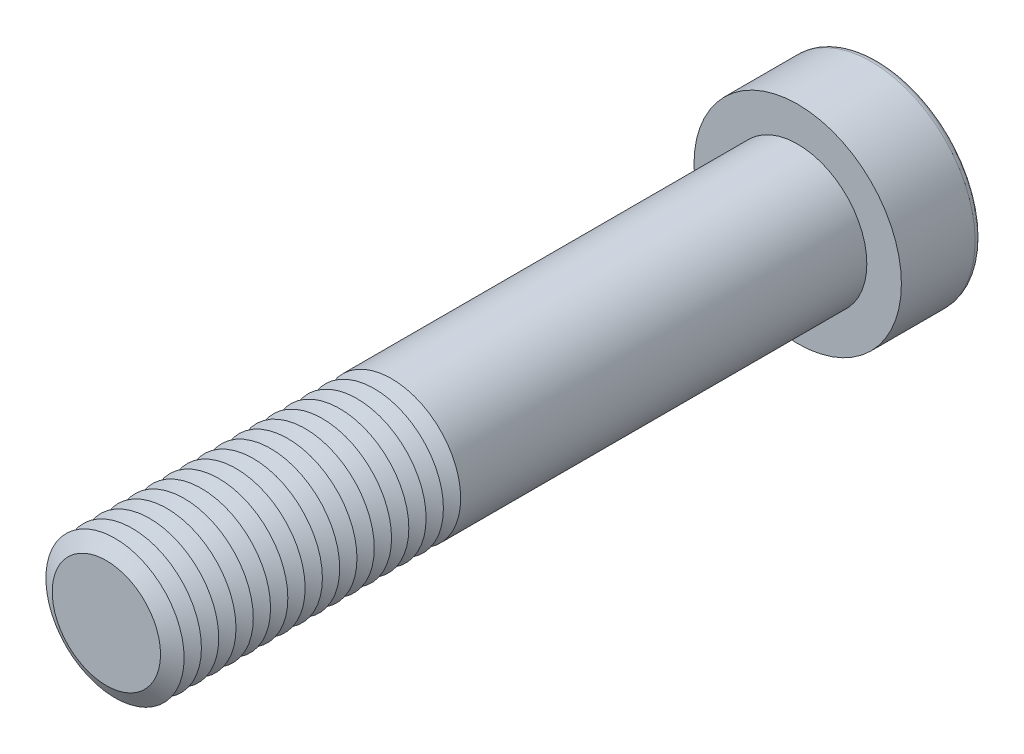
ISO-10303-21;
HEADER;
FILE_DESCRIPTION(('STEP AP214'),'2;1');
FILE_NAME('part.step','',(''),(''),'','','');
FILE_SCHEMA(('AUTOMOTIVE_DESIGN { 1 0 10303 214 1 1 1 1 }'));
ENDSEC;
DATA;
#1=APPLICATION_CONTEXT('core data for automotive mechanical design processes');
#2=APPLICATION_PROTOCOL_DEFINITION('international standard','automotive_design',2000,#1);
#3=PRODUCT_CONTEXT('',#1,'mechanical');
#4=PRODUCT('Part','Part','',(#3));
#5=PRODUCT_RELATED_PRODUCT_CATEGORY('part','',(#4));
#6=PRODUCT_DEFINITION_FORMATION('','',#4);
#7=PRODUCT_DEFINITION_CONTEXT('part definition',#1,'design');
#8=PRODUCT_DEFINITION('design','',#6,#7);
#9=PRODUCT_DEFINITION_SHAPE('','',#8);
#10=(LENGTH_UNIT() NAMED_UNIT(*) SI_UNIT(.MILLI.,.METRE.));
#11=(NAMED_UNIT(*) PLANE_ANGLE_UNIT() SI_UNIT($,.RADIAN.));
#12=(NAMED_UNIT(*) SI_UNIT($,.STERADIAN.) SOLID_ANGLE_UNIT());
#13=UNCERTAINTY_MEASURE_WITH_UNIT(LENGTH_MEASURE(1.E-05),#10,'distance_accuracy_value','');
#14=(GEOMETRIC_REPRESENTATION_CONTEXT(3) GLOBAL_UNCERTAINTY_ASSIGNED_CONTEXT((#13)) GLOBAL_UNIT_ASSIGNED_CONTEXT((#10,
#11,#12)) REPRESENTATION_CONTEXT('',''));
#15=CARTESIAN_POINT('',(0.,0.,0.));
#16=DIRECTION('',(0.,0.,1.));
#17=DIRECTION('',(1.,0.,0.));
#18=AXIS2_PLACEMENT_3D('',#15,#16,#17);
#19=CARTESIAN_POINT('',(0.,0.,109.5));
#20=DIRECTION('',(0.,0.,1.));
#21=DIRECTION('',(1.,0.,0.));
#22=AXIS2_PLACEMENT_3D('',#19,#20,#21);
#23=CONICAL_SURFACE('',#22,12.,1.0471975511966);
#24=CARTESIAN_POINT('',(0.,0.,108.));
#25=DIRECTION('',(0.,0.,1.));
#26=DIRECTION('',(1.,0.,0.));
#27=AXIS2_PLACEMENT_3D('',#24,#25,#26);
#28=CIRCLE('',#27,9.40192378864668);
#29=CARTESIAN_POINT('',(9.40192378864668,0.,108.));
#30=VERTEX_POINT('',#29);
#31=EDGE_CURVE('E313',#30,#30,#28,.T.);
#32=ORIENTED_EDGE('',*,*,#31,.T.);
#33=EDGE_LOOP('',(#32));
#34=FACE_BOUND('',#33,.T.);
#35=CARTESIAN_POINT('',(0.,0.,109.5));
#36=DIRECTION('',(0.,0.,1.));
#37=DIRECTION('',(1.,0.,0.));
#38=AXIS2_PLACEMENT_3D('',#35,#36,#37);
#39=CIRCLE('',#38,12.);
#40=CARTESIAN_POINT('',(12.,0.,109.5));
#41=VERTEX_POINT('',#40);
#42=EDGE_CURVE('E316',#41,#41,#39,.T.);
#43=ORIENTED_EDGE('',*,*,#42,.F.);
#44=EDGE_LOOP('',(#43));
#45=FACE_BOUND('',#44,.T.);
#46=ADVANCED_FACE('F39',(#34,#45),#23,.T.);
#47=CARTESIAN_POINT('',(0.,0.,108.));
#48=DIRECTION('',(0.,0.,-1.));
#49=DIRECTION('',(-1.,0.,0.));
#50=AXIS2_PLACEMENT_3D('',#47,#48,#49);
#51=CONICAL_SURFACE('',#50,9.40192378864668,1.0471975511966);
#52=CARTESIAN_POINT('',(0.,0.,106.5));
#53=DIRECTION('',(0.,0.,1.));
#54=DIRECTION('',(1.,0.,0.));
#55=AXIS2_PLACEMENT_3D('',#52,#53,#54);
#56=CIRCLE('',#55,12.);
#57=CARTESIAN_POINT('',(12.,0.,106.5));
#58=VERTEX_POINT('',#57);
#59=EDGE_CURVE('E324',#58,#58,#56,.T.);
#60=ORIENTED_EDGE('',*,*,#59,.T.);
#61=EDGE_LOOP('',(#60));
#62=FACE_BOUND('',#61,.T.);
#63=ORIENTED_EDGE('',*,*,#31,.F.);
#64=EDGE_LOOP('',(#63));
#65=FACE_BOUND('',#64,.T.);
#66=ADVANCED_FACE('F245',(#62,#65),#51,.T.);
#67=CARTESIAN_POINT('',(0.,0.,120.));
#68=DIRECTION('',(0.,0.,1.));
#69=DIRECTION('',(1.,0.,0.));
#70=AXIS2_PLACEMENT_3D('',#67,#68,#69);
#71=PLANE('',#70);
#72=CARTESIAN_POINT('',(0.,0.,120.));
#73=DIRECTION('',(0.,0.,1.));
#74=DIRECTION('',(1.,0.,0.));
#75=AXIS2_PLACEMENT_3D('',#72,#73,#74);
#76=CIRCLE('',#75,9.40192378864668);
#77=CARTESIAN_POINT('',(9.40192378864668,0.,120.));
#78=VERTEX_POINT('',#77);
#79=EDGE_CURVE('E174',#78,#78,#76,.T.);
#80=ORIENTED_EDGE('',*,*,#79,.T.);
#81=EDGE_LOOP('',(#80));
#82=FACE_BOUND('',#81,.T.);
#83=ADVANCED_FACE('F251',(#82),#71,.T.);
#84=CARTESIAN_POINT('',(0.,0.,120.));
#85=DIRECTION('',(0.,0.,-1.));
#86=DIRECTION('',(-1.,0.,0.));
#87=AXIS2_PLACEMENT_3D('',#84,#85,#86);
#88=CONICAL_SURFACE('',#87,9.40192378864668,1.0471975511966);
#89=CARTESIAN_POINT('',(0.,0.,118.5));
#90=DIRECTION('',(0.,0.,1.));
#91=DIRECTION('',(1.,0.,0.));
#92=AXIS2_PLACEMENT_3D('',#89,#90,#91);
#93=CIRCLE('',#92,12.);
#94=CARTESIAN_POINT('',(12.,0.,118.5));
#95=VERTEX_POINT('',#94);
#96=EDGE_CURVE('E291',#95,#95,#93,.T.);
#97=ORIENTED_EDGE('',*,*,#96,.T.);
#98=EDGE_LOOP('',(#97));
#99=FACE_BOUND('',#98,.T.);
#100=ORIENTED_EDGE('',*,*,#79,.F.);
#101=EDGE_LOOP('',(#100));
#102=FACE_BOUND('',#101,.T.);
#103=ADVANCED_FACE('F199',(#99,#102),#88,.T.);
#104=CARTESIAN_POINT('',(0.,0.,118.5));
#105=DIRECTION('',(0.,0.,1.));
#106=DIRECTION('',(1.,0.,0.));
#107=AXIS2_PLACEMENT_3D('',#104,#105,#106);
#108=CONICAL_SURFACE('',#107,12.,1.0471975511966);
#109=CARTESIAN_POINT('',(0.,0.,117.));
#110=DIRECTION('',(0.,0.,1.));
#111=DIRECTION('',(1.,0.,0.));
#112=AXIS2_PLACEMENT_3D('',#109,#110,#111);
#113=CIRCLE('',#112,9.40192378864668);
#114=CARTESIAN_POINT('',(9.40192378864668,0.,117.));
#115=VERTEX_POINT('',#114);
#116=EDGE_CURVE('E288',#115,#115,#113,.T.);
#117=ORIENTED_EDGE('',*,*,#116,.T.);
#118=EDGE_LOOP('',(#117));
#119=FACE_BOUND('',#118,.T.);
#120=ORIENTED_EDGE('',*,*,#96,.F.);
#121=EDGE_LOOP('',(#120));
#122=FACE_BOUND('',#121,.T.);
#123=ADVANCED_FACE('F277',(#119,#122),#108,.T.);
#124=CARTESIAN_POINT('',(0.,0.,117.));
#125=DIRECTION('',(0.,0.,-1.));
#126=DIRECTION('',(-1.,0.,0.));
#127=AXIS2_PLACEMENT_3D('',#124,#125,#126);
#128=CONICAL_SURFACE('',#127,9.40192378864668,1.0471975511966);
#129=CARTESIAN_POINT('',(0.,0.,115.5));
#130=DIRECTION('',(0.,0.,1.));
#131=DIRECTION('',(1.,0.,0.));
#132=AXIS2_PLACEMENT_3D('',#129,#130,#131);
#133=CIRCLE('',#132,12.);
#134=CARTESIAN_POINT('',(12.,0.,115.5));
#135=VERTEX_POINT('',#134);
#136=EDGE_CURVE('E300',#135,#135,#133,.T.);
#137=ORIENTED_EDGE('',*,*,#136,.T.);
#138=EDGE_LOOP('',(#137));
#139=FACE_BOUND('',#138,.T.);
#140=ORIENTED_EDGE('',*,*,#116,.F.);
#141=EDGE_LOOP('',(#140));
#142=FACE_BOUND('',#141,.T.);
#143=ADVANCED_FACE('F274',(#139,#142),#128,.T.);
#144=CARTESIAN_POINT('',(0.,0.,115.5));
#145=DIRECTION('',(0.,0.,1.));
#146=DIRECTION('',(1.,0.,0.));
#147=AXIS2_PLACEMENT_3D('',#144,#145,#146);
#148=CONICAL_SURFACE('',#147,12.,1.0471975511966);
#149=CARTESIAN_POINT('',(0.,0.,114.));
#150=DIRECTION('',(0.,0.,1.));
#151=DIRECTION('',(1.,0.,0.));
#152=AXIS2_PLACEMENT_3D('',#149,#150,#151);
#153=CIRCLE('',#152,9.40192378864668);
#154=CARTESIAN_POINT('',(9.40192378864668,0.,114.));
#155=VERTEX_POINT('',#154);
#156=EDGE_CURVE('E293',#155,#155,#153,.T.);
#157=ORIENTED_EDGE('',*,*,#156,.T.);
#158=EDGE_LOOP('',(#157));
#159=FACE_BOUND('',#158,.T.);
#160=ORIENTED_EDGE('',*,*,#136,.F.);
#161=EDGE_LOOP('',(#160));
#162=FACE_BOUND('',#161,.T.);
#163=ADVANCED_FACE('F270',(#159,#162),#148,.T.);
#164=CARTESIAN_POINT('',(0.,0.,114.));
#165=DIRECTION('',(0.,0.,-1.));
#166=DIRECTION('',(-1.,0.,0.));
#167=AXIS2_PLACEMENT_3D('',#164,#165,#166);
#168=CONICAL_SURFACE('',#167,9.40192378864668,1.0471975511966);
#169=CARTESIAN_POINT('',(0.,0.,112.5));
#170=DIRECTION('',(0.,0.,1.));
#171=DIRECTION('',(1.,0.,0.));
#172=AXIS2_PLACEMENT_3D('',#169,#170,#171);
#173=CIRCLE('',#172,12.);
#174=CARTESIAN_POINT('',(12.,0.,112.5));
#175=VERTEX_POINT('',#174);
#176=EDGE_CURVE('E309',#175,#175,#173,.T.);
#177=ORIENTED_EDGE('',*,*,#176,.T.);
#178=EDGE_LOOP('',(#177));
#179=FACE_BOUND('',#178,.T.);
#180=ORIENTED_EDGE('',*,*,#156,.F.);
#181=EDGE_LOOP('',(#180));
#182=FACE_BOUND('',#181,.T.);
#183=ADVANCED_FACE('F266',(#179,#182),#168,.T.);
#184=CARTESIAN_POINT('',(0.,0.,112.5));
#185=DIRECTION('',(0.,0.,1.));
#186=DIRECTION('',(1.,0.,0.));
#187=AXIS2_PLACEMENT_3D('',#184,#185,#186);
#188=CONICAL_SURFACE('',#187,12.,1.0471975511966);
#189=CARTESIAN_POINT('',(0.,0.,111.));
#190=DIRECTION('',(0.,0.,1.));
#191=DIRECTION('',(1.,0.,0.));
#192=AXIS2_PLACEMENT_3D('',#189,#190,#191);
#193=CIRCLE('',#192,9.40192378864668);
#194=CARTESIAN_POINT('',(9.40192378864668,0.,111.));
#195=VERTEX_POINT('',#194);
#196=EDGE_CURVE('E306',#195,#195,#193,.T.);
#197=ORIENTED_EDGE('',*,*,#196,.T.);
#198=EDGE_LOOP('',(#197));
#199=FACE_BOUND('',#198,.T.);
#200=ORIENTED_EDGE('',*,*,#176,.F.);
#201=EDGE_LOOP('',(#200));
#202=FACE_BOUND('',#201,.T.);
#203=ADVANCED_FACE('F262',(#199,#202),#188,.T.);
#204=CARTESIAN_POINT('',(0.,0.,111.));
#205=DIRECTION('',(0.,0.,-1.));
#206=DIRECTION('',(-1.,0.,0.));
#207=AXIS2_PLACEMENT_3D('',#204,#205,#206);
#208=CONICAL_SURFACE('',#207,9.40192378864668,1.0471975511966);
#209=ORIENTED_EDGE('',*,*,#42,.T.);
#210=EDGE_LOOP('',(#209));
#211=FACE_BOUND('',#210,.T.);
#212=ORIENTED_EDGE('',*,*,#196,.F.);
#213=EDGE_LOOP('',(#212));
#214=FACE_BOUND('',#213,.T.);
#215=ADVANCED_FACE('F258',(#211,#214),#208,.T.);
#216=CARTESIAN_POINT('',(0.,0.,106.5));
#217=DIRECTION('',(0.,0.,1.));
#218=DIRECTION('',(1.,0.,0.));
#219=AXIS2_PLACEMENT_3D('',#216,#217,#218);
#220=CONICAL_SURFACE('',#219,12.,1.0471975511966);
#221=CARTESIAN_POINT('',(0.,0.,105.));
#222=DIRECTION('',(0.,0.,1.));
#223=DIRECTION('',(1.,0.,0.));
#224=AXIS2_PLACEMENT_3D('',#221,#222,#223);
#225=CIRCLE('',#224,9.40192378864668);
#226=CARTESIAN_POINT('',(9.40192378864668,0.,105.));
#227=VERTEX_POINT('',#226);
#228=EDGE_CURVE('E320',#227,#227,#225,.T.);
#229=ORIENTED_EDGE('',*,*,#228,.T.);
#230=EDGE_LOOP('',(#229));
#231=FACE_BOUND('',#230,.T.);
#232=ORIENTED_EDGE('',*,*,#59,.F.);
#233=EDGE_LOOP('',(#232));
#234=FACE_BOUND('',#233,.T.);
#235=ADVANCED_FACE('F261',(#231,#234),#220,.T.);
#236=CARTESIAN_POINT('',(0.,0.,105.));
#237=DIRECTION('',(0.,0.,-1.));
#238=DIRECTION('',(-1.,0.,0.));
#239=AXIS2_PLACEMENT_3D('',#236,#237,#238);
#240=CONICAL_SURFACE('',#239,9.40192378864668,1.0471975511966);
#241=CARTESIAN_POINT('',(0.,0.,103.5));
#242=DIRECTION('',(0.,0.,1.));
#243=DIRECTION('',(1.,0.,0.));
#244=AXIS2_PLACEMENT_3D('',#241,#242,#243);
#245=CIRCLE('',#244,12.);
#246=CARTESIAN_POINT('',(12.,0.,103.5));
#247=VERTEX_POINT('',#246);
#248=EDGE_CURVE('E332',#247,#247,#245,.T.);
#249=ORIENTED_EDGE('',*,*,#248,.T.);
#250=EDGE_LOOP('',(#249));
#251=FACE_BOUND('',#250,.T.);
#252=ORIENTED_EDGE('',*,*,#228,.F.);
#253=EDGE_LOOP('',(#252));
#254=FACE_BOUND('',#253,.T.);
#255=ADVANCED_FACE('F513',(#251,#254),#240,.T.);
#256=CARTESIAN_POINT('',(0.,0.,103.5));
#257=DIRECTION('',(0.,0.,1.));
#258=DIRECTION('',(1.,0.,0.));
#259=AXIS2_PLACEMENT_3D('',#256,#257,#258);
#260=CONICAL_SURFACE('',#259,12.,1.0471975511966);
#261=CARTESIAN_POINT('',(0.,0.,102.));
#262=DIRECTION('',(0.,0.,1.));
#263=DIRECTION('',(1.,0.,0.));
#264=AXIS2_PLACEMENT_3D('',#261,#262,#263);
#265=CIRCLE('',#264,9.40192378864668);
#266=CARTESIAN_POINT('',(9.40192378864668,0.,102.));
#267=VERTEX_POINT('',#266);
#268=EDGE_CURVE('E328',#267,#267,#265,.T.);
#269=ORIENTED_EDGE('',*,*,#268,.T.);
#270=EDGE_LOOP('',(#269));
#271=FACE_BOUND('',#270,.T.);
#272=ORIENTED_EDGE('',*,*,#248,.F.);
#273=EDGE_LOOP('',(#272));
#274=FACE_BOUND('',#273,.T.);
#275=ADVANCED_FACE('F509',(#271,#274),#260,.T.);
#276=CARTESIAN_POINT('',(0.,0.,102.));
#277=DIRECTION('',(0.,0.,-1.));
#278=DIRECTION('',(-1.,0.,0.));
#279=AXIS2_PLACEMENT_3D('',#276,#277,#278);
#280=CONICAL_SURFACE('',#279,9.40192378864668,1.0471975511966);
#281=CARTESIAN_POINT('',(0.,0.,100.5));
#282=DIRECTION('',(0.,0.,1.));
#283=DIRECTION('',(1.,0.,0.));
#284=AXIS2_PLACEMENT_3D('',#281,#282,#283);
#285=CIRCLE('',#284,12.);
#286=CARTESIAN_POINT('',(12.,0.,100.5));
#287=VERTEX_POINT('',#286);
#288=EDGE_CURVE('E340',#287,#287,#285,.T.);
#289=ORIENTED_EDGE('',*,*,#288,.T.);
#290=EDGE_LOOP('',(#289));
#291=FACE_BOUND('',#290,.T.);
#292=ORIENTED_EDGE('',*,*,#268,.F.);
#293=EDGE_LOOP('',(#292));
#294=FACE_BOUND('',#293,.T.);
#295=ADVANCED_FACE('F505',(#291,#294),#280,.T.);
#296=CARTESIAN_POINT('',(0.,0.,100.5));
#297=DIRECTION('',(0.,0.,1.));
#298=DIRECTION('',(1.,0.,0.));
#299=AXIS2_PLACEMENT_3D('',#296,#297,#298);
#300=CONICAL_SURFACE('',#299,12.,1.0471975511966);
#301=CARTESIAN_POINT('',(0.,0.,99.));
#302=DIRECTION('',(0.,0.,1.));
#303=DIRECTION('',(1.,0.,0.));
#304=AXIS2_PLACEMENT_3D('',#301,#302,#303);
#305=CIRCLE('',#304,9.40192378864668);
#306=CARTESIAN_POINT('',(9.40192378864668,0.,99.));
#307=VERTEX_POINT('',#306);
#308=EDGE_CURVE('E336',#307,#307,#305,.T.);
#309=ORIENTED_EDGE('',*,*,#308,.T.);
#310=EDGE_LOOP('',(#309));
#311=FACE_BOUND('',#310,.T.);
#312=ORIENTED_EDGE('',*,*,#288,.F.);
#313=EDGE_LOOP('',(#312));
#314=FACE_BOUND('',#313,.T.);
#315=ADVANCED_FACE('F501',(#311,#314),#300,.T.);
#316=CARTESIAN_POINT('',(0.,0.,99.));
#317=DIRECTION('',(0.,0.,-1.));
#318=DIRECTION('',(-1.,0.,0.));
#319=AXIS2_PLACEMENT_3D('',#316,#317,#318);
#320=CONICAL_SURFACE('',#319,9.40192378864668,1.0471975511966);
#321=CARTESIAN_POINT('',(0.,0.,97.5));
#322=DIRECTION('',(0.,0.,1.));
#323=DIRECTION('',(1.,0.,0.));
#324=AXIS2_PLACEMENT_3D('',#321,#322,#323);
#325=CIRCLE('',#324,12.);
#326=CARTESIAN_POINT('',(12.,0.,97.5));
#327=VERTEX_POINT('',#326);
#328=EDGE_CURVE('E348',#327,#327,#325,.T.);
#329=ORIENTED_EDGE('',*,*,#328,.T.);
#330=EDGE_LOOP('',(#329));
#331=FACE_BOUND('',#330,.T.);
#332=ORIENTED_EDGE('',*,*,#308,.F.);
#333=EDGE_LOOP('',(#332));
#334=FACE_BOUND('',#333,.T.);
#335=ADVANCED_FACE('F497',(#331,#334),#320,.T.);
#336=CARTESIAN_POINT('',(0.,0.,97.5));
#337=DIRECTION('',(0.,0.,1.));
#338=DIRECTION('',(1.,0.,0.));
#339=AXIS2_PLACEMENT_3D('',#336,#337,#338);
#340=CONICAL_SURFACE('',#339,12.,1.0471975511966);
#341=CARTESIAN_POINT('',(0.,0.,96.));
#342=DIRECTION('',(0.,0.,1.));
#343=DIRECTION('',(1.,0.,0.));
#344=AXIS2_PLACEMENT_3D('',#341,#342,#343);
#345=CIRCLE('',#344,9.40192378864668);
#346=CARTESIAN_POINT('',(9.40192378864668,0.,96.));
#347=VERTEX_POINT('',#346);
#348=EDGE_CURVE('E344',#347,#347,#345,.T.);
#349=ORIENTED_EDGE('',*,*,#348,.T.);
#350=EDGE_LOOP('',(#349));
#351=FACE_BOUND('',#350,.T.);
#352=ORIENTED_EDGE('',*,*,#328,.F.);
#353=EDGE_LOOP('',(#352));
#354=FACE_BOUND('',#353,.T.);
#355=ADVANCED_FACE('F493',(#351,#354),#340,.T.);
#356=CARTESIAN_POINT('',(0.,0.,96.));
#357=DIRECTION('',(0.,0.,-1.));
#358=DIRECTION('',(-1.,0.,0.));
#359=AXIS2_PLACEMENT_3D('',#356,#357,#358);
#360=CONICAL_SURFACE('',#359,9.40192378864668,1.0471975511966);
#361=CARTESIAN_POINT('',(0.,0.,94.5));
#362=DIRECTION('',(0.,0.,1.));
#363=DIRECTION('',(1.,0.,0.));
#364=AXIS2_PLACEMENT_3D('',#361,#362,#363);
#365=CIRCLE('',#364,12.);
#366=CARTESIAN_POINT('',(12.,0.,94.5));
#367=VERTEX_POINT('',#366);
#368=EDGE_CURVE('E356',#367,#367,#365,.T.);
#369=ORIENTED_EDGE('',*,*,#368,.T.);
#370=EDGE_LOOP('',(#369));
#371=FACE_BOUND('',#370,.T.);
#372=ORIENTED_EDGE('',*,*,#348,.F.);
#373=EDGE_LOOP('',(#372));
#374=FACE_BOUND('',#373,.T.);
#375=ADVANCED_FACE('F489',(#371,#374),#360,.T.);
#376=CARTESIAN_POINT('',(0.,0.,94.5));
#377=DIRECTION('',(0.,0.,1.));
#378=DIRECTION('',(1.,0.,0.));
#379=AXIS2_PLACEMENT_3D('',#376,#377,#378);
#380=CONICAL_SURFACE('',#379,12.,1.0471975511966);
#381=CARTESIAN_POINT('',(0.,0.,93.));
#382=DIRECTION('',(0.,0.,1.));
#383=DIRECTION('',(1.,0.,0.));
#384=AXIS2_PLACEMENT_3D('',#381,#382,#383);
#385=CIRCLE('',#384,9.40192378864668);
#386=CARTESIAN_POINT('',(9.40192378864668,0.,93.));
#387=VERTEX_POINT('',#386);
#388=EDGE_CURVE('E352',#387,#387,#385,.T.);
#389=ORIENTED_EDGE('',*,*,#388,.T.);
#390=EDGE_LOOP('',(#389));
#391=FACE_BOUND('',#390,.T.);
#392=ORIENTED_EDGE('',*,*,#368,.F.);
#393=EDGE_LOOP('',(#392));
#394=FACE_BOUND('',#393,.T.);
#395=ADVANCED_FACE('F485',(#391,#394),#380,.T.);
#396=CARTESIAN_POINT('',(0.,0.,93.));
#397=DIRECTION('',(0.,0.,-1.));
#398=DIRECTION('',(-1.,0.,0.));
#399=AXIS2_PLACEMENT_3D('',#396,#397,#398);
#400=CONICAL_SURFACE('',#399,9.40192378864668,1.0471975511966);
#401=CARTESIAN_POINT('',(0.,0.,91.5));
#402=DIRECTION('',(0.,0.,1.));
#403=DIRECTION('',(1.,0.,0.));
#404=AXIS2_PLACEMENT_3D('',#401,#402,#403);
#405=CIRCLE('',#404,12.);
#406=CARTESIAN_POINT('',(12.,0.,91.5));
#407=VERTEX_POINT('',#406);
#408=EDGE_CURVE('E364',#407,#407,#405,.T.);
#409=ORIENTED_EDGE('',*,*,#408,.T.);
#410=EDGE_LOOP('',(#409));
#411=FACE_BOUND('',#410,.T.);
#412=ORIENTED_EDGE('',*,*,#388,.F.);
#413=EDGE_LOOP('',(#412));
#414=FACE_BOUND('',#413,.T.);
#415=ADVANCED_FACE('F481',(#411,#414),#400,.T.);
#416=CARTESIAN_POINT('',(0.,0.,91.5));
#417=DIRECTION('',(0.,0.,1.));
#418=DIRECTION('',(1.,0.,0.));
#419=AXIS2_PLACEMENT_3D('',#416,#417,#418);
#420=CONICAL_SURFACE('',#419,12.,1.0471975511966);
#421=CARTESIAN_POINT('',(0.,0.,90.));
#422=DIRECTION('',(0.,0.,1.));
#423=DIRECTION('',(1.,0.,0.));
#424=AXIS2_PLACEMENT_3D('',#421,#422,#423);
#425=CIRCLE('',#424,9.40192378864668);
#426=CARTESIAN_POINT('',(9.40192378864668,0.,90.));
#427=VERTEX_POINT('',#426);
#428=EDGE_CURVE('E360',#427,#427,#425,.T.);
#429=ORIENTED_EDGE('',*,*,#428,.T.);
#430=EDGE_LOOP('',(#429));
#431=FACE_BOUND('',#430,.T.);
#432=ORIENTED_EDGE('',*,*,#408,.F.);
#433=EDGE_LOOP('',(#432));
#434=FACE_BOUND('',#433,.T.);
#435=ADVANCED_FACE('F477',(#431,#434),#420,.T.);
#436=CARTESIAN_POINT('',(0.,0.,90.));
#437=DIRECTION('',(0.,0.,-1.));
#438=DIRECTION('',(-1.,0.,0.));
#439=AXIS2_PLACEMENT_3D('',#436,#437,#438);
#440=CONICAL_SURFACE('',#439,9.40192378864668,1.0471975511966);
#441=CARTESIAN_POINT('',(0.,0.,88.5));
#442=DIRECTION('',(0.,0.,1.));
#443=DIRECTION('',(1.,0.,0.));
#444=AXIS2_PLACEMENT_3D('',#441,#442,#443);
#445=CIRCLE('',#444,12.);
#446=CARTESIAN_POINT('',(12.,0.,88.5));
#447=VERTEX_POINT('',#446);
#448=EDGE_CURVE('E372',#447,#447,#445,.T.);
#449=ORIENTED_EDGE('',*,*,#448,.T.);
#450=EDGE_LOOP('',(#449));
#451=FACE_BOUND('',#450,.T.);
#452=ORIENTED_EDGE('',*,*,#428,.F.);
#453=EDGE_LOOP('',(#452));
#454=FACE_BOUND('',#453,.T.);
#455=ADVANCED_FACE('F473',(#451,#454),#440,.T.);
#456=CARTESIAN_POINT('',(0.,0.,88.5));
#457=DIRECTION('',(0.,0.,1.));
#458=DIRECTION('',(1.,0.,0.));
#459=AXIS2_PLACEMENT_3D('',#456,#457,#458);
#460=CONICAL_SURFACE('',#459,12.,1.0471975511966);
#461=CARTESIAN_POINT('',(0.,0.,87.));
#462=DIRECTION('',(0.,0.,1.));
#463=DIRECTION('',(1.,0.,0.));
#464=AXIS2_PLACEMENT_3D('',#461,#462,#463);
#465=CIRCLE('',#464,9.40192378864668);
#466=CARTESIAN_POINT('',(9.40192378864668,0.,87.));
#467=VERTEX_POINT('',#466);
#468=EDGE_CURVE('E368',#467,#467,#465,.T.);
#469=ORIENTED_EDGE('',*,*,#468,.T.);
#470=EDGE_LOOP('',(#469));
#471=FACE_BOUND('',#470,.T.);
#472=ORIENTED_EDGE('',*,*,#448,.F.);
#473=EDGE_LOOP('',(#472));
#474=FACE_BOUND('',#473,.T.);
#475=ADVANCED_FACE('F469',(#471,#474),#460,.T.);
#476=CARTESIAN_POINT('',(0.,0.,87.));
#477=DIRECTION('',(0.,0.,-1.));
#478=DIRECTION('',(-1.,0.,0.));
#479=AXIS2_PLACEMENT_3D('',#476,#477,#478);
#480=CONICAL_SURFACE('',#479,9.40192378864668,1.0471975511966);
#481=CARTESIAN_POINT('',(0.,0.,85.5));
#482=DIRECTION('',(0.,0.,1.));
#483=DIRECTION('',(1.,0.,0.));
#484=AXIS2_PLACEMENT_3D('',#481,#482,#483);
#485=CIRCLE('',#484,12.);
#486=CARTESIAN_POINT('',(12.,0.,85.5));
#487=VERTEX_POINT('',#486);
#488=EDGE_CURVE('E380',#487,#487,#485,.T.);
#489=ORIENTED_EDGE('',*,*,#488,.T.);
#490=EDGE_LOOP('',(#489));
#491=FACE_BOUND('',#490,.T.);
#492=ORIENTED_EDGE('',*,*,#468,.F.);
#493=EDGE_LOOP('',(#492));
#494=FACE_BOUND('',#493,.T.);
#495=ADVANCED_FACE('F465',(#491,#494),#480,.T.);
#496=CARTESIAN_POINT('',(0.,0.,85.5));
#497=DIRECTION('',(0.,0.,1.));
#498=DIRECTION('',(1.,0.,0.));
#499=AXIS2_PLACEMENT_3D('',#496,#497,#498);
#500=CONICAL_SURFACE('',#499,12.,1.0471975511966);
#501=CARTESIAN_POINT('',(0.,0.,84.));
#502=DIRECTION('',(0.,0.,1.));
#503=DIRECTION('',(1.,0.,0.));
#504=AXIS2_PLACEMENT_3D('',#501,#502,#503);
#505=CIRCLE('',#504,9.40192378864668);
#506=CARTESIAN_POINT('',(9.40192378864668,0.,84.));
#507=VERTEX_POINT('',#506);
#508=EDGE_CURVE('E376',#507,#507,#505,.T.);
#509=ORIENTED_EDGE('',*,*,#508,.T.);
#510=EDGE_LOOP('',(#509));
#511=FACE_BOUND('',#510,.T.);
#512=ORIENTED_EDGE('',*,*,#488,.F.);
#513=EDGE_LOOP('',(#512));
#514=FACE_BOUND('',#513,.T.);
#515=ADVANCED_FACE('F461',(#511,#514),#500,.T.);
#516=CARTESIAN_POINT('',(0.,0.,84.));
#517=DIRECTION('',(0.,0.,-1.));
#518=DIRECTION('',(-1.,0.,0.));
#519=AXIS2_PLACEMENT_3D('',#516,#517,#518);
#520=CONICAL_SURFACE('',#519,9.40192378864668,1.0471975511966);
#521=CARTESIAN_POINT('',(0.,0.,82.5));
#522=DIRECTION('',(0.,0.,1.));
#523=DIRECTION('',(1.,0.,0.));
#524=AXIS2_PLACEMENT_3D('',#521,#522,#523);
#525=CIRCLE('',#524,12.);
#526=CARTESIAN_POINT('',(12.,0.,82.5));
#527=VERTEX_POINT('',#526);
#528=EDGE_CURVE('E388',#527,#527,#525,.T.);
#529=ORIENTED_EDGE('',*,*,#528,.T.);
#530=EDGE_LOOP('',(#529));
#531=FACE_BOUND('',#530,.T.);
#532=ORIENTED_EDGE('',*,*,#508,.F.);
#533=EDGE_LOOP('',(#532));
#534=FACE_BOUND('',#533,.T.);
#535=ADVANCED_FACE('F457',(#531,#534),#520,.T.);
#536=CARTESIAN_POINT('',(0.,0.,82.5));
#537=DIRECTION('',(0.,0.,1.));
#538=DIRECTION('',(1.,0.,0.));
#539=AXIS2_PLACEMENT_3D('',#536,#537,#538);
#540=CONICAL_SURFACE('',#539,12.,1.0471975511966);
#541=CARTESIAN_POINT('',(0.,0.,81.));
#542=DIRECTION('',(0.,0.,1.));
#543=DIRECTION('',(1.,0.,0.));
#544=AXIS2_PLACEMENT_3D('',#541,#542,#543);
#545=CIRCLE('',#544,9.40192378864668);
#546=CARTESIAN_POINT('',(9.40192378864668,0.,81.));
#547=VERTEX_POINT('',#546);
#548=EDGE_CURVE('E384',#547,#547,#545,.T.);
#549=ORIENTED_EDGE('',*,*,#548,.T.);
#550=EDGE_LOOP('',(#549));
#551=FACE_BOUND('',#550,.T.);
#552=ORIENTED_EDGE('',*,*,#528,.F.);
#553=EDGE_LOOP('',(#552));
#554=FACE_BOUND('',#553,.T.);
#555=ADVANCED_FACE('F453',(#551,#554),#540,.T.);
#556=CARTESIAN_POINT('',(0.,0.,81.));
#557=DIRECTION('',(0.,0.,-1.));
#558=DIRECTION('',(-1.,0.,0.));
#559=AXIS2_PLACEMENT_3D('',#556,#557,#558);
#560=CONICAL_SURFACE('',#559,9.40192378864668,1.0471975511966);
#561=CARTESIAN_POINT('',(0.,0.,79.5));
#562=DIRECTION('',(0.,0.,1.));
#563=DIRECTION('',(1.,0.,0.));
#564=AXIS2_PLACEMENT_3D('',#561,#562,#563);
#565=CIRCLE('',#564,12.);
#566=CARTESIAN_POINT('',(12.,0.,79.5));
#567=VERTEX_POINT('',#566);
#568=EDGE_CURVE('E396',#567,#567,#565,.T.);
#569=ORIENTED_EDGE('',*,*,#568,.T.);
#570=EDGE_LOOP('',(#569));
#571=FACE_BOUND('',#570,.T.);
#572=ORIENTED_EDGE('',*,*,#548,.F.);
#573=EDGE_LOOP('',(#572));
#574=FACE_BOUND('',#573,.T.);
#575=ADVANCED_FACE('F449',(#571,#574),#560,.T.);
#576=CARTESIAN_POINT('',(0.,0.,79.5));
#577=DIRECTION('',(0.,0.,1.));
#578=DIRECTION('',(1.,0.,0.));
#579=AXIS2_PLACEMENT_3D('',#576,#577,#578);
#580=CONICAL_SURFACE('',#579,12.,1.0471975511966);
#581=CARTESIAN_POINT('',(0.,0.,78.));
#582=DIRECTION('',(0.,0.,1.));
#583=DIRECTION('',(1.,0.,0.));
#584=AXIS2_PLACEMENT_3D('',#581,#582,#583);
#585=CIRCLE('',#584,9.40192378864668);
#586=CARTESIAN_POINT('',(9.40192378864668,0.,78.));
#587=VERTEX_POINT('',#586);
#588=EDGE_CURVE('E392',#587,#587,#585,.T.);
#589=ORIENTED_EDGE('',*,*,#588,.T.);
#590=EDGE_LOOP('',(#589));
#591=FACE_BOUND('',#590,.T.);
#592=ORIENTED_EDGE('',*,*,#568,.F.);
#593=EDGE_LOOP('',(#592));
#594=FACE_BOUND('',#593,.T.);
#595=ADVANCED_FACE('F445',(#591,#594),#580,.T.);
#596=CARTESIAN_POINT('',(0.,0.,78.));
#597=DIRECTION('',(0.,0.,-1.));
#598=DIRECTION('',(-1.,0.,0.));
#599=AXIS2_PLACEMENT_3D('',#596,#597,#598);
#600=CONICAL_SURFACE('',#599,9.40192378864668,1.0471975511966);
#601=CARTESIAN_POINT('',(0.,0.,76.5));
#602=DIRECTION('',(0.,0.,1.));
#603=DIRECTION('',(1.,0.,0.));
#604=AXIS2_PLACEMENT_3D('',#601,#602,#603);
#605=CIRCLE('',#604,12.);
#606=CARTESIAN_POINT('',(12.,0.,76.5));
#607=VERTEX_POINT('',#606);
#608=EDGE_CURVE('E404',#607,#607,#605,.T.);
#609=ORIENTED_EDGE('',*,*,#608,.T.);
#610=EDGE_LOOP('',(#609));
#611=FACE_BOUND('',#610,.T.);
#612=ORIENTED_EDGE('',*,*,#588,.F.);
#613=EDGE_LOOP('',(#612));
#614=FACE_BOUND('',#613,.T.);
#615=ADVANCED_FACE('F441',(#611,#614),#600,.T.);
#616=CARTESIAN_POINT('',(0.,0.,76.5));
#617=DIRECTION('',(0.,0.,1.));
#618=DIRECTION('',(1.,0.,0.));
#619=AXIS2_PLACEMENT_3D('',#616,#617,#618);
#620=CONICAL_SURFACE('',#619,12.,1.0471975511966);
#621=CARTESIAN_POINT('',(0.,0.,75.));
#622=DIRECTION('',(0.,0.,1.));
#623=DIRECTION('',(1.,0.,0.));
#624=AXIS2_PLACEMENT_3D('',#621,#622,#623);
#625=CIRCLE('',#624,9.40192378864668);
#626=CARTESIAN_POINT('',(9.40192378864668,0.,75.));
#627=VERTEX_POINT('',#626);
#628=EDGE_CURVE('E400',#627,#627,#625,.T.);
#629=ORIENTED_EDGE('',*,*,#628,.T.);
#630=EDGE_LOOP('',(#629));
#631=FACE_BOUND('',#630,.T.);
#632=ORIENTED_EDGE('',*,*,#608,.F.);
#633=EDGE_LOOP('',(#632));
#634=FACE_BOUND('',#633,.T.);
#635=ADVANCED_FACE('F436',(#631,#634),#620,.T.);
#636=CARTESIAN_POINT('',(0.,0.,75.));
#637=DIRECTION('',(0.,0.,-1.));
#638=DIRECTION('',(-1.,0.,0.));
#639=AXIS2_PLACEMENT_3D('',#636,#637,#638);
#640=CONICAL_SURFACE('',#639,9.40192378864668,1.0471975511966);
#641=CARTESIAN_POINT('',(0.,0.,73.5));
#642=DIRECTION('',(0.,0.,1.));
#643=DIRECTION('',(1.,0.,0.));
#644=AXIS2_PLACEMENT_3D('',#641,#642,#643);
#645=CIRCLE('',#644,12.);
#646=CARTESIAN_POINT('',(12.,0.,73.5));
#647=VERTEX_POINT('',#646);
#648=EDGE_CURVE('E416',#647,#647,#645,.T.);
#649=ORIENTED_EDGE('',*,*,#648,.T.);
#650=EDGE_LOOP('',(#649));
#651=FACE_BOUND('',#650,.T.);
#652=ORIENTED_EDGE('',*,*,#628,.F.);
#653=EDGE_LOOP('',(#652));
#654=FACE_BOUND('',#653,.T.);
#655=ADVANCED_FACE('F422',(#651,#654),#640,.T.);
#656=CARTESIAN_POINT('',(0.,0.,73.5));
#657=DIRECTION('',(0.,0.,1.));
#658=DIRECTION('',(1.,0.,0.));
#659=AXIS2_PLACEMENT_3D('',#656,#657,#658);
#660=CONICAL_SURFACE('',#659,12.,1.0471975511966);
#661=CARTESIAN_POINT('',(0.,0.,72.));
#662=DIRECTION('',(0.,0.,1.));
#663=DIRECTION('',(1.,0.,0.));
#664=AXIS2_PLACEMENT_3D('',#661,#662,#663);
#665=CIRCLE('',#664,9.40192378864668);
#666=CARTESIAN_POINT('',(9.40192378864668,0.,72.));
#667=VERTEX_POINT('',#666);
#668=EDGE_CURVE('E408',#667,#667,#665,.T.);
#669=ORIENTED_EDGE('',*,*,#668,.T.);
#670=EDGE_LOOP('',(#669));
#671=FACE_BOUND('',#670,.T.);
#672=ORIENTED_EDGE('',*,*,#648,.F.);
#673=EDGE_LOOP('',(#672));
#674=FACE_BOUND('',#673,.T.);
#675=ADVANCED_FACE('F425',(#671,#674),#660,.T.);
#676=CARTESIAN_POINT('',(0.,0.,72.));
#677=DIRECTION('',(0.,0.,-1.));
#678=DIRECTION('',(-1.,0.,0.));
#679=AXIS2_PLACEMENT_3D('',#676,#677,#678);
#680=CONICAL_SURFACE('',#679,9.40192378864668,1.0471975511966);
#681=CARTESIAN_POINT('',(0.,0.,70.5));
#682=DIRECTION('',(0.,0.,1.));
#683=DIRECTION('',(1.,0.,0.));
#684=AXIS2_PLACEMENT_3D('',#681,#682,#683);
#685=CIRCLE('',#684,12.);
#686=CARTESIAN_POINT('',(12.,0.,70.5));
#687=VERTEX_POINT('',#686);
#688=EDGE_CURVE('E412',#687,#687,#685,.T.);
#689=ORIENTED_EDGE('',*,*,#688,.T.);
#690=EDGE_LOOP('',(#689));
#691=FACE_BOUND('',#690,.T.);
#692=ORIENTED_EDGE('',*,*,#668,.F.);
#693=EDGE_LOOP('',(#692));
#694=FACE_BOUND('',#693,.T.);
#695=ADVANCED_FACE('F427',(#691,#694),#680,.T.);
#696=CARTESIAN_POINT('',(0.,0.,0.25));
#697=DIRECTION('',(0.,0.,-1.));
#698=DIRECTION('',(-1.,0.,0.));
#699=AXIS2_PLACEMENT_3D('',#696,#697,#698);
#700=CONICAL_SURFACE('',#699,9.5,1.0471975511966);
#701=CARTESIAN_POINT('',(0.,0.,5.73482755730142));
#702=VERTEX_POINT('',#701);
#703=VERTEX_LOOP('',#702);
#704=FACE_BOUND('',#703,.T.);
#705=CARTESIAN_POINT('',(0.,0.,0.25));
#706=DIRECTION('',(0.,0.,-1.));
#707=DIRECTION('',(-1.,0.,0.));
#708=AXIS2_PLACEMENT_3D('',#705,#706,#707);
#709=CIRCLE('',#708,9.5);
#710=CARTESIAN_POINT('',(-8.22724133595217,4.75,0.25));
#711=VERTEX_POINT('',#710);
#712=CARTESIAN_POINT('',(0.,9.5,0.25));
#713=VERTEX_POINT('',#712);
#714=EDGE_CURVE('E149',#711,#713,#709,.T.);
#715=ORIENTED_EDGE('',*,*,#714,.T.);
#716=CARTESIAN_POINT('',(0.,0.,0.25));
#717=DIRECTION('',(0.,0.,-1.));
#718=DIRECTION('',(-1.,0.,0.));
#719=AXIS2_PLACEMENT_3D('',#716,#717,#718);
#720=CIRCLE('',#719,9.5);
#721=CARTESIAN_POINT('',(8.22724133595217,4.75,0.25));
#722=VERTEX_POINT('',#721);
#723=EDGE_CURVE('E54',#713,#722,#720,.T.);
#724=ORIENTED_EDGE('',*,*,#723,.T.);
#725=CARTESIAN_POINT('',(8.22724133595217,-4.75,0.25));
#726=VERTEX_POINT('',#725);
#727=EDGE_CURVE('E1026',#722,#726,#720,.T.);
#728=ORIENTED_EDGE('',*,*,#727,.T.);
#729=CARTESIAN_POINT('',(0.,-9.5,0.25));
#730=VERTEX_POINT('',#729);
#731=EDGE_CURVE('E1025',#726,#730,#720,.T.);
#732=ORIENTED_EDGE('',*,*,#731,.T.);
#733=CARTESIAN_POINT('',(-8.22724133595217,-4.75,0.25));
#734=VERTEX_POINT('',#733);
#735=EDGE_CURVE('E1019',#730,#734,#720,.T.);
#736=ORIENTED_EDGE('',*,*,#735,.T.);
#737=EDGE_CURVE('E1017',#734,#711,#720,.T.);
#738=ORIENTED_EDGE('',*,*,#737,.T.);
#739=EDGE_LOOP('',(#715,#724,#728,#732,#736,#738));
#740=FACE_BOUND('',#739,.T.);
#741=ADVANCED_FACE('F201',(#704,#740),#700,.F.);
#742=CARTESIAN_POINT('',(0.,0.,0.25));
#743=DIRECTION('',(0.,0.,-1.));
#744=DIRECTION('',(-1.,0.,0.));
#745=AXIS2_PLACEMENT_3D('',#742,#743,#744);
#746=PLANE('',#745);
#747=ORIENTED_EDGE('',*,*,#723,.F.);
#748=DIRECTION('',(1.,0.,0.));
#749=VECTOR('',#748,1.);
#750=CARTESIAN_POINT('',(-5.48482755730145,9.5,0.25));
#751=LINE('',#750,#749);
#752=CARTESIAN_POINT('',(5.48482755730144,9.5,0.25));
#753=VERTEX_POINT('',#752);
#754=EDGE_CURVE('E1069',#713,#753,#751,.T.);
#755=ORIENTED_EDGE('',*,*,#754,.T.);
#756=DIRECTION('',(0.5,-0.866025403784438,0.));
#757=VECTOR('',#756,1.);
#758=CARTESIAN_POINT('',(5.48482755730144,9.5,0.25));
#759=LINE('',#758,#757);
#760=EDGE_CURVE('E155',#753,#722,#759,.T.);
#761=ORIENTED_EDGE('',*,*,#760,.T.);
#762=EDGE_LOOP('',(#747,#755,#761));
#763=FACE_BOUND('',#762,.T.);
#764=ADVANCED_FACE('F608',(#763),#746,.T.);
#765=ORIENTED_EDGE('',*,*,#727,.F.);
#766=CARTESIAN_POINT('',(10.9696551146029,0.,0.25));
#767=VERTEX_POINT('',#766);
#768=EDGE_CURVE('E1068',#722,#767,#759,.T.);
#769=ORIENTED_EDGE('',*,*,#768,.T.);
#770=DIRECTION('',(-0.5,-0.866025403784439,0.));
#771=VECTOR('',#770,1.);
#772=CARTESIAN_POINT('',(10.9696551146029,0.,0.25));
#773=LINE('',#772,#771);
#774=EDGE_CURVE('E1042',#767,#726,#773,.T.);
#775=ORIENTED_EDGE('',*,*,#774,.T.);
#776=EDGE_LOOP('',(#765,#769,#775));
#777=FACE_BOUND('',#776,.T.);
#778=ADVANCED_FACE('F618',(#777),#746,.T.);
#779=ORIENTED_EDGE('',*,*,#731,.F.);
#780=CARTESIAN_POINT('',(5.48482755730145,-9.5,0.25));
#781=VERTEX_POINT('',#780);
#782=EDGE_CURVE('E1044',#726,#781,#773,.T.);
#783=ORIENTED_EDGE('',*,*,#782,.T.);
#784=DIRECTION('',(-1.,0.,0.));
#785=VECTOR('',#784,1.);
#786=CARTESIAN_POINT('',(5.48482755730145,-9.5,0.25));
#787=LINE('',#786,#785);
#788=EDGE_CURVE('E993',#781,#730,#787,.T.);
#789=ORIENTED_EDGE('',*,*,#788,.T.);
#790=EDGE_LOOP('',(#779,#783,#789));
#791=FACE_BOUND('',#790,.T.);
#792=ADVANCED_FACE('F628',(#791),#746,.T.);
#793=ORIENTED_EDGE('',*,*,#735,.F.);
#794=CARTESIAN_POINT('',(-5.48482755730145,-9.5,0.25));
#795=VERTEX_POINT('',#794);
#796=EDGE_CURVE('E1038',#730,#795,#787,.T.);
#797=ORIENTED_EDGE('',*,*,#796,.T.);
#798=DIRECTION('',(-0.5,0.866025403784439,0.));
#799=VECTOR('',#798,1.);
#800=CARTESIAN_POINT('',(-5.48482755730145,-9.5,0.25));
#801=LINE('',#800,#799);
#802=EDGE_CURVE('E1040',#795,#734,#801,.T.);
#803=ORIENTED_EDGE('',*,*,#802,.T.);
#804=EDGE_LOOP('',(#793,#797,#803));
#805=FACE_BOUND('',#804,.T.);
#806=ADVANCED_FACE('F636',(#805),#746,.T.);
#807=ORIENTED_EDGE('',*,*,#737,.F.);
#808=CARTESIAN_POINT('',(-10.9696551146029,0.,0.25));
#809=VERTEX_POINT('',#808);
#810=EDGE_CURVE('E1046',#734,#809,#801,.T.);
#811=ORIENTED_EDGE('',*,*,#810,.T.);
#812=DIRECTION('',(0.5,0.866025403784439,0.));
#813=VECTOR('',#812,1.);
#814=CARTESIAN_POINT('',(-10.9696551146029,0.,0.25));
#815=LINE('',#814,#813);
#816=EDGE_CURVE('E158',#809,#711,#815,.T.);
#817=ORIENTED_EDGE('',*,*,#816,.T.);
#818=EDGE_LOOP('',(#807,#811,#817));
#819=FACE_BOUND('',#818,.T.);
#820=ADVANCED_FACE('F231',(#819),#746,.T.);
#821=ORIENTED_EDGE('',*,*,#714,.F.);
#822=CARTESIAN_POINT('',(-5.48482755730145,9.5,0.25));
#823=VERTEX_POINT('',#822);
#824=EDGE_CURVE('E1052',#711,#823,#815,.T.);
#825=ORIENTED_EDGE('',*,*,#824,.T.);
#826=EDGE_CURVE('E1067',#823,#713,#751,.T.);
#827=ORIENTED_EDGE('',*,*,#826,.T.);
#828=EDGE_LOOP('',(#821,#825,#827));
#829=FACE_BOUND('',#828,.T.);
#830=ADVANCED_FACE('F620',(#829),#746,.T.);
#831=CARTESIAN_POINT('',(-5.48482755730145,9.5,0.25));
#832=DIRECTION('',(0.,1.,0.));
#833=DIRECTION('',(0.,0.,1.));
#834=AXIS2_PLACEMENT_3D('',#831,#832,#833);
#835=PLANE('',#834);
#836=DIRECTION('',(0.,0.,-1.));
#837=VECTOR('',#836,1.);
#838=CARTESIAN_POINT('',(-5.48482755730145,9.5,0.25));
#839=LINE('',#838,#837);
#840=CARTESIAN_POINT('',(-5.48482755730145,9.5,-14.));
#841=VERTEX_POINT('',#840);
#842=EDGE_CURVE('E147',#823,#841,#839,.T.);
#843=ORIENTED_EDGE('',*,*,#842,.T.);
#844=CARTESIAN_POINT('',(-14.3184360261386,9.5,-15.6649552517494));
#845=CARTESIAN_POINT('',(-13.8894653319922,9.5,-15.5692031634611));
#846=CARTESIAN_POINT('',(-13.460220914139,9.5,-15.4746548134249));
#847=CARTESIAN_POINT('',(-12.6010505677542,9.5,-15.2886152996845));
#848=CARTESIAN_POINT('',(-12.1711246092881,9.5,-15.1971242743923));
#849=CARTESIAN_POINT('',(-11.3100507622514,9.5,-15.0177651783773));
#850=CARTESIAN_POINT('',(-10.8789020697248,9.5,-14.9299009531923));
#851=CARTESIAN_POINT('',(-10.0156929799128,9.5,-14.7587741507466));
#852=CARTESIAN_POINT('',(-9.5836325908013,9.5,-14.67551153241));
#853=CARTESIAN_POINT('',(-8.72220045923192,9.5,-14.5153788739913));
#854=CARTESIAN_POINT('',(-8.29283790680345,9.5,-14.4384596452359));
#855=CARTESIAN_POINT('',(-7.43292010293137,9.5,-14.2915458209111));
#856=CARTESIAN_POINT('',(-7.0023648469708,9.5,-14.2215512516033));
#857=CARTESIAN_POINT('',(-6.14001360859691,9.5,-14.0901048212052));
#858=CARTESIAN_POINT('',(-5.70821784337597,9.5,-14.0286515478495));
#859=CARTESIAN_POINT('',(-4.84325961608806,9.5,-13.9161318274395));
#860=CARTESIAN_POINT('',(-4.41009715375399,9.5,-13.8650653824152));
#861=CARTESIAN_POINT('',(-3.53757113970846,9.5,-13.7748018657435));
#862=CARTESIAN_POINT('',(-3.09819281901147,9.5,-13.7357454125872));
#863=CARTESIAN_POINT('',(-2.2183738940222,9.5,-13.6722240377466));
#864=CARTESIAN_POINT('',(-1.77793331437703,9.5,-13.6477587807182));
#865=CARTESIAN_POINT('',(-0.896631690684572,9.5,-13.6148480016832));
#866=CARTESIAN_POINT('',(-0.455770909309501,9.5,-13.606395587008));
#867=CARTESIAN_POINT('',(0.425958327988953,9.5,-13.606024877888));
#868=CARTESIAN_POINT('',(0.866826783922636,9.5,-13.614106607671));
#869=CARTESIAN_POINT('',(1.74977048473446,9.5,-13.6463580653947));
#870=CARTESIAN_POINT('',(2.1918432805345,9.5,-13.6705935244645));
#871=CARTESIAN_POINT('',(3.07492453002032,9.5,-13.7337958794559));
#872=CARTESIAN_POINT('',(3.5159329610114,9.5,-13.7727630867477));
#873=CARTESIAN_POINT('',(4.39689734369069,9.5,-13.8635087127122));
#874=CARTESIAN_POINT('',(4.83685243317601,9.5,-13.9152953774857));
#875=CARTESIAN_POINT('',(5.71535222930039,9.5,-14.0295826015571));
#876=CARTESIAN_POINT('',(6.15389693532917,9.5,-14.0920831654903));
#877=CARTESIAN_POINT('',(7.04109045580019,9.5,-14.2276023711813));
#878=CARTESIAN_POINT('',(7.48970345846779,9.5,-14.3008534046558));
#879=CARTESIAN_POINT('',(8.38565999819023,9.5,-14.4547834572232));
#880=CARTESIAN_POINT('',(8.83300349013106,9.5,-14.5354627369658));
#881=CARTESIAN_POINT('',(9.72662836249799,9.5,-14.7027801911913));
#882=CARTESIAN_POINT('',(10.1729095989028,9.5,-14.7894191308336));
#883=CARTESIAN_POINT('',(11.0645098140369,9.5,-14.9674686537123));
#884=CARTESIAN_POINT('',(11.5098288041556,9.5,-15.0588791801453));
#885=CARTESIAN_POINT('',(12.3998049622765,9.5,-15.2455765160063));
#886=CARTESIAN_POINT('',(12.8444618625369,9.5,-15.3408645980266));
#887=CARTESIAN_POINT('',(13.7330947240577,9.5,-15.5345693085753));
#888=CARTESIAN_POINT('',(14.1770706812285,9.5,-15.6329859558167));
#889=CARTESIAN_POINT('',(15.5080689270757,9.5,-15.9320263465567));
#890=CARTESIAN_POINT('',(16.3942355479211,9.5,-16.1364562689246));
#891=CARTESIAN_POINT('',(18.1541693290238,9.5,-16.5497091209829));
#892=CARTESIAN_POINT('',(19.0279562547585,9.5,-16.7584484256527));
#893=CARTESIAN_POINT('',(20.7743818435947,9.5,-17.180754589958));
#894=CARTESIAN_POINT('',(21.647020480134,9.5,-17.3943215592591));
#895=CARTESIAN_POINT('',(23.3902098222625,9.5,-17.8246823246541));
#896=CARTESIAN_POINT('',(24.2607617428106,9.5,-18.0414712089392));
#897=CARTESIAN_POINT('',(25.5660757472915,9.5,-18.3686360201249));
#898=CARTESIAN_POINT('',(26.0010870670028,9.5,-18.4780192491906));
#899=CARTESIAN_POINT('',(26.8709622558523,9.5,-18.6973688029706));
#900=CARTESIAN_POINT('',(27.3058261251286,9.5,-18.8073351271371));
#901=CARTESIAN_POINT('',(27.7406260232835,9.5,-18.9175537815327));
#902=B_SPLINE_CURVE_WITH_KNOTS('',3,(#844,#845,#846,#847,#848,#849,#850,#851,#852,#853,#854,
#855,#856,#857,#858,#859,#860,#861,#862,#863,#864,#865,#866,#867,#868,#869,#870,#871,#872,#873,
#874,#875,#876,#877,#878,#879,#880,#881,#882,#883,#884,#885,#886,#887,#888,#889,#890,#891,#892,
#893,#894,#895,#896,#897,#898,#899,#900,#901),.UNSPECIFIED.,.F.,.F.,(4,2,2,2,2,2,2,2,2,2,2,2,2,
2,2,2,2,2,2,2,2,2,2,2,2,2,2,2,4),(0.,1.31858776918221,2.63723515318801,3.9572465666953,
5.27724619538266,6.5857950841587,7.89434893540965,9.20268616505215,10.5110236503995,
11.8341427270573,13.1572313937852,14.4797504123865,15.8022713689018,17.1302069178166,
18.4581705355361,19.7869905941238,21.1158112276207,22.4793957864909,23.8430282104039,
25.2068360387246,26.5706276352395,27.9348704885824,29.2991215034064,32.0273967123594,
34.7225025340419,37.4176696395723,40.1090806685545,41.4547385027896,42.8003950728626),.UNSPECIFIED.);
#903=CARTESIAN_POINT('',(5.48482755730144,9.50000000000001,-14.));
#904=VERTEX_POINT('',#903);
#905=EDGE_CURVE('E124',#841,#904,#902,.T.);
#906=ORIENTED_EDGE('',*,*,#905,.T.);
#907=DIRECTION('',(0.,0.,-1.));
#908=VECTOR('',#907,1.);
#909=CARTESIAN_POINT('',(5.48482755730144,9.5,0.25));
#910=LINE('',#909,#908);
#911=EDGE_CURVE('E143',#753,#904,#910,.T.);
#912=ORIENTED_EDGE('',*,*,#911,.F.);
#913=ORIENTED_EDGE('',*,*,#754,.F.);
#914=ORIENTED_EDGE('',*,*,#826,.F.);
#915=EDGE_LOOP('',(#843,#906,#912,#913,#914));
#916=FACE_BOUND('',#915,.T.);
#917=ADVANCED_FACE('F141',(#916),#835,.F.);
#918=CARTESIAN_POINT('',(5.48482755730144,9.5,0.25));
#919=DIRECTION('',(0.866025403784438,0.5,0.));
#920=DIRECTION('',(-0.5,0.866025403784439,0.));
#921=AXIS2_PLACEMENT_3D('',#918,#919,#920);
#922=PLANE('',#921);
#923=ORIENTED_EDGE('',*,*,#911,.T.);
#924=CARTESIAN_POINT('',(5.4847120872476,9.5002,-14.0000309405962));
#925=CARTESIAN_POINT('',(5.71249277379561,9.10567227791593,-13.9389722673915));
#926=CARTESIAN_POINT('',(5.9406864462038,8.71042924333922,-13.8835411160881));
#927=CARTESIAN_POINT('',(6.39787965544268,7.918547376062,-13.7861538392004));
#928=CARTESIAN_POINT('',(6.6268794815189,7.52190804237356,-13.7442031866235));
#929=CARTESIAN_POINT('',(7.08429660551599,6.72963834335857,-13.6762259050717));
#930=CARTESIAN_POINT('',(7.31271081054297,6.33401333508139,-13.6501182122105));
#931=CARTESIAN_POINT('',(7.76983049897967,5.54225880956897,-13.6151104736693));
#932=CARTESIAN_POINT('',(7.99853591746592,5.14612940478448,-13.6062070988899));
#933=CARTESIAN_POINT('',(8.45594675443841,4.35387059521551,-13.6062070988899));
#934=CARTESIAN_POINT('',(8.68465217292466,3.95774119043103,-13.6151104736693));
#935=CARTESIAN_POINT('',(9.14177186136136,3.16598666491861,-13.6501182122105));
#936=CARTESIAN_POINT('',(9.37018606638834,2.77036165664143,-13.6762259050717));
#937=CARTESIAN_POINT('',(9.82760319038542,1.97809195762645,-13.7442031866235));
#938=CARTESIAN_POINT('',(10.0566030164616,1.581452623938,-13.7861538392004));
#939=CARTESIAN_POINT('',(10.5137962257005,0.789570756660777,-13.8835411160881));
#940=CARTESIAN_POINT('',(10.7419898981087,0.394327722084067,-13.9389722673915));
#941=CARTESIAN_POINT('',(10.9697705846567,-0.000199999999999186,-14.0000309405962));
#942=B_SPLINE_CURVE_WITH_KNOTS('',3,(#924,#925,#926,#927,#928,#929,#930,#931,#932,#933,#934,
#935,#936,#937,#938,#939,#940,#941),.UNSPECIFIED.,.F.,.F.,(4,2,2,2,2,2,2,2,4),(0.,
1.37897722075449,2.75851359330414,4.13093041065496,5.50308163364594,6.87523285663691,
8.24764967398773,9.62718604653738,11.0061632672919),.UNSPECIFIED.);
#943=CARTESIAN_POINT('',(10.9696551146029,0.,-14.));
#944=VERTEX_POINT('',#943);
#945=EDGE_CURVE('E11',#904,#944,#942,.T.);
#946=ORIENTED_EDGE('',*,*,#945,.T.);
#947=DIRECTION('',(0.,0.,-1.));
#948=VECTOR('',#947,1.);
#949=CARTESIAN_POINT('',(10.9696551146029,0.,0.25));
#950=LINE('',#949,#948);
#951=EDGE_CURVE('E157',#767,#944,#950,.T.);
#952=ORIENTED_EDGE('',*,*,#951,.F.);
#953=ORIENTED_EDGE('',*,*,#768,.F.);
#954=ORIENTED_EDGE('',*,*,#760,.F.);
#955=EDGE_LOOP('',(#923,#946,#952,#953,#954));
#956=FACE_BOUND('',#955,.T.);
#957=ADVANCED_FACE('F152',(#956),#922,.F.);
#958=CARTESIAN_POINT('',(10.9696551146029,0.,0.25));
#959=DIRECTION('',(0.866025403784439,-0.5,0.));
#960=DIRECTION('',(0.5,0.866025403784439,0.));
#961=AXIS2_PLACEMENT_3D('',#958,#959,#960);
#962=PLANE('',#961);
#963=ORIENTED_EDGE('',*,*,#951,.T.);
#964=CARTESIAN_POINT('',(10.9697705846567,0.000200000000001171,-14.0000309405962));
#965=CARTESIAN_POINT('',(10.7419898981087,-0.394327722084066,-13.9389722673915));
#966=CARTESIAN_POINT('',(10.5137962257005,-0.789570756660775,-13.8835411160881));
#967=CARTESIAN_POINT('',(10.0566030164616,-1.581452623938,-13.7861538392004));
#968=CARTESIAN_POINT('',(9.82760319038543,-1.97809195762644,-13.7442031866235));
#969=CARTESIAN_POINT('',(9.37018606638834,-2.77036165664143,-13.6762259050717));
#970=CARTESIAN_POINT('',(9.14177186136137,-3.16598666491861,-13.6501182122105));
#971=CARTESIAN_POINT('',(8.68465217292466,-3.95774119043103,-13.6151104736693));
#972=CARTESIAN_POINT('',(8.45594675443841,-4.35387059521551,-13.6062070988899));
#973=CARTESIAN_POINT('',(7.99853591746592,-5.14612940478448,-13.6062070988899));
#974=CARTESIAN_POINT('',(7.76983049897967,-5.54225880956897,-13.6151104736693));
#975=CARTESIAN_POINT('',(7.31271081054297,-6.33401333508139,-13.6501182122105));
#976=CARTESIAN_POINT('',(7.08429660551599,-6.72963834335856,-13.6762259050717));
#977=CARTESIAN_POINT('',(6.62687948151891,-7.52190804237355,-13.7442031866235));
#978=CARTESIAN_POINT('',(6.39787965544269,-7.918547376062,-13.7861538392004));
#979=CARTESIAN_POINT('',(5.9406864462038,-8.71042924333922,-13.8835411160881));
#980=CARTESIAN_POINT('',(5.71249277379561,-9.10567227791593,-13.9389722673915));
#981=CARTESIAN_POINT('',(5.48471208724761,-9.5002,-14.0000309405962));
#982=B_SPLINE_CURVE_WITH_KNOTS('',3,(#964,#965,#966,#967,#968,#969,#970,#971,#972,#973,#974,
#975,#976,#977,#978,#979,#980,#981),.UNSPECIFIED.,.F.,.F.,(4,2,2,2,2,2,2,2,4),(0.,
1.37897722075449,2.75851359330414,4.13093041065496,5.50308163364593,6.87523285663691,
8.24764967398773,9.62718604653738,11.0061632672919),.UNSPECIFIED.);
#983=CARTESIAN_POINT('',(5.48482755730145,-9.5,-14.));
#984=VERTEX_POINT('',#983);
#985=EDGE_CURVE('E173',#944,#984,#982,.T.);
#986=ORIENTED_EDGE('',*,*,#985,.T.);
#987=DIRECTION('',(0.,0.,-1.));
#988=VECTOR('',#987,1.);
#989=CARTESIAN_POINT('',(5.48482755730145,-9.5,0.25));
#990=LINE('',#989,#988);
#991=EDGE_CURVE('E988',#781,#984,#990,.T.);
#992=ORIENTED_EDGE('',*,*,#991,.F.);
#993=ORIENTED_EDGE('',*,*,#782,.F.);
#994=ORIENTED_EDGE('',*,*,#774,.F.);
#995=EDGE_LOOP('',(#963,#986,#992,#993,#994));
#996=FACE_BOUND('',#995,.T.);
#997=ADVANCED_FACE('F191',(#996),#962,.F.);
#998=CARTESIAN_POINT('',(5.48482755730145,-9.5,0.25));
#999=DIRECTION('',(0.,-1.,0.));
#1000=DIRECTION('',(0.,0.,-1.));
#1001=AXIS2_PLACEMENT_3D('',#998,#999,#1000);
#1002=PLANE('',#1001);
#1003=ORIENTED_EDGE('',*,*,#991,.T.);
#1004=CARTESIAN_POINT('',(-14.3184360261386,-9.5,-15.6649552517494));
#1005=CARTESIAN_POINT('',(-13.8894653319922,-9.5,-15.5692031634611));
#1006=CARTESIAN_POINT('',(-13.460220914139,-9.5,-15.4746548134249));
#1007=CARTESIAN_POINT('',(-12.6010505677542,-9.5,-15.2886152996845));
#1008=CARTESIAN_POINT('',(-12.1711246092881,-9.5,-15.1971242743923));
#1009=CARTESIAN_POINT('',(-11.3100507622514,-9.5,-15.0177651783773));
#1010=CARTESIAN_POINT('',(-10.8789020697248,-9.5,-14.9299009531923));
#1011=CARTESIAN_POINT('',(-10.0156929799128,-9.5,-14.7587741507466));
#1012=CARTESIAN_POINT('',(-9.58363259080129,-9.5,-14.67551153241));
#1013=CARTESIAN_POINT('',(-8.72220045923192,-9.5,-14.5153788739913));
#1014=CARTESIAN_POINT('',(-8.29283790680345,-9.5,-14.4384596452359));
#1015=CARTESIAN_POINT('',(-7.43292010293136,-9.5,-14.2915458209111));
#1016=CARTESIAN_POINT('',(-7.00236484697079,-9.5,-14.2215512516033));
#1017=CARTESIAN_POINT('',(-6.1400136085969,-9.5,-14.0901048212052));
#1018=CARTESIAN_POINT('',(-5.70821784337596,-9.5,-14.0286515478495));
#1019=CARTESIAN_POINT('',(-4.84325961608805,-9.5,-13.9161318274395));
#1020=CARTESIAN_POINT('',(-4.41009715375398,-9.5,-13.8650653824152));
#1021=CARTESIAN_POINT('',(-3.53757113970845,-9.5,-13.7748018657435));
#1022=CARTESIAN_POINT('',(-3.09819281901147,-9.5,-13.7357454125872));
#1023=CARTESIAN_POINT('',(-2.2183738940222,-9.5,-13.6722240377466));
#1024=CARTESIAN_POINT('',(-1.77793331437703,-9.5,-13.6477587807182));
#1025=CARTESIAN_POINT('',(-0.896631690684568,-9.5,-13.6148480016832));
#1026=CARTESIAN_POINT('',(-0.455770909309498,-9.5,-13.606395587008));
#1027=CARTESIAN_POINT('',(0.425958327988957,-9.5,-13.606024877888));
#1028=CARTESIAN_POINT('',(0.866826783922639,-9.5,-13.614106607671));
#1029=CARTESIAN_POINT('',(1.74977048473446,-9.5,-13.6463580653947));
#1030=CARTESIAN_POINT('',(2.1918432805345,-9.5,-13.6705935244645));
#1031=CARTESIAN_POINT('',(3.07492453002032,-9.5,-13.7337958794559));
#1032=CARTESIAN_POINT('',(3.5159329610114,-9.5,-13.7727630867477));
#1033=CARTESIAN_POINT('',(4.39689734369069,-9.5,-13.8635087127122));
#1034=CARTESIAN_POINT('',(4.83685243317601,-9.5,-13.9152953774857));
#1035=CARTESIAN_POINT('',(5.71535222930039,-9.5,-14.0295826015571));
#1036=CARTESIAN_POINT('',(6.15389693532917,-9.5,-14.0920831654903));
#1037=CARTESIAN_POINT('',(7.04109045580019,-9.5,-14.2276023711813));
#1038=CARTESIAN_POINT('',(7.48970345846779,-9.5,-14.3008534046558));
#1039=CARTESIAN_POINT('',(8.38565999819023,-9.5,-14.4547834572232));
#1040=CARTESIAN_POINT('',(8.83300349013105,-9.5,-14.5354627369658));
#1041=CARTESIAN_POINT('',(9.72662836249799,-9.5,-14.7027801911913));
#1042=CARTESIAN_POINT('',(10.1729095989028,-9.5,-14.7894191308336));
#1043=CARTESIAN_POINT('',(11.0645098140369,-9.5,-14.9674686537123));
#1044=CARTESIAN_POINT('',(11.5098288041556,-9.5,-15.0588791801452));
#1045=CARTESIAN_POINT('',(12.3998049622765,-9.5,-15.2455765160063));
#1046=CARTESIAN_POINT('',(12.8444618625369,-9.5,-15.3408645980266));
#1047=CARTESIAN_POINT('',(13.7330947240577,-9.5,-15.5345693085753));
#1048=CARTESIAN_POINT('',(14.1770706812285,-9.5,-15.6329859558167));
#1049=CARTESIAN_POINT('',(15.5080689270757,-9.5,-15.9320263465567));
#1050=CARTESIAN_POINT('',(16.3942355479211,-9.5,-16.1364562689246));
#1051=CARTESIAN_POINT('',(18.1541693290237,-9.5,-16.5497091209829));
#1052=CARTESIAN_POINT('',(19.0279562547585,-9.5,-16.7584484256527));
#1053=CARTESIAN_POINT('',(20.7743818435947,-9.5,-17.180754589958));
#1054=CARTESIAN_POINT('',(21.647020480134,-9.5,-17.3943215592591));
#1055=CARTESIAN_POINT('',(23.3902098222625,-9.5,-17.8246823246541));
#1056=CARTESIAN_POINT('',(24.2607617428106,-9.5,-18.0414712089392));
#1057=CARTESIAN_POINT('',(25.5660757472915,-9.5,-18.3686360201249));
#1058=CARTESIAN_POINT('',(26.0010870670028,-9.5,-18.4780192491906));
#1059=CARTESIAN_POINT('',(26.8709622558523,-9.5,-18.6973688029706));
#1060=CARTESIAN_POINT('',(27.3058261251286,-9.5,-18.8073351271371));
#1061=CARTESIAN_POINT('',(27.7406260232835,-9.5,-18.9175537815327));
#1062=B_SPLINE_CURVE_WITH_KNOTS('',3,(#1004,#1005,#1006,#1007,#1008,#1009,#1010,#1011,#1012,
#1013,#1014,#1015,#1016,#1017,#1018,#1019,#1020,#1021,#1022,#1023,#1024,#1025,#1026,#1027,#1028,
#1029,#1030,#1031,#1032,#1033,#1034,#1035,#1036,#1037,#1038,#1039,#1040,#1041,#1042,#1043,#1044,
#1045,#1046,#1047,#1048,#1049,#1050,#1051,#1052,#1053,#1054,#1055,#1056,#1057,#1058,#1059,#1060,
#1061),.UNSPECIFIED.,.F.,.F.,(4,2,2,2,2,2,2,2,2,2,2,2,2,2,2,2,2,2,2,2,2,2,2,2,2,2,2,2,4),(0.,
1.3185877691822,2.63723515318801,3.9572465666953,5.27724619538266,6.5857950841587,
7.89434893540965,9.20268616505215,10.5110236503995,11.8341427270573,13.1572313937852,
14.4797504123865,15.8022713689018,17.1302069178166,18.4581705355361,19.7869905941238,
21.1158112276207,22.4793957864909,23.8430282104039,25.2068360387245,26.5706276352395,
27.9348704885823,29.2991215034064,32.0273967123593,34.7225025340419,37.4176696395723,
40.1090806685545,41.4547385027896,42.8003950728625),.UNSPECIFIED.);
#1063=CARTESIAN_POINT('',(-5.48482755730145,-9.5,-14.));
#1064=VERTEX_POINT('',#1063);
#1065=EDGE_CURVE('E184',#984,#1064,#1062,.F.);
#1066=ORIENTED_EDGE('',*,*,#1065,.T.);
#1067=DIRECTION('',(0.,0.,-1.));
#1068=VECTOR('',#1067,1.);
#1069=CARTESIAN_POINT('',(-5.48482755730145,-9.5,0.25));
#1070=LINE('',#1069,#1068);
#1071=EDGE_CURVE('E995',#795,#1064,#1070,.T.);
#1072=ORIENTED_EDGE('',*,*,#1071,.F.);
#1073=ORIENTED_EDGE('',*,*,#796,.F.);
#1074=ORIENTED_EDGE('',*,*,#788,.F.);
#1075=EDGE_LOOP('',(#1003,#1066,#1072,#1073,#1074));
#1076=FACE_BOUND('',#1075,.T.);
#1077=ADVANCED_FACE('F234',(#1076),#1002,.F.);
#1078=CARTESIAN_POINT('',(-5.48482755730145,-9.5,0.25));
#1079=DIRECTION('',(-0.866025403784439,-0.5,0.));
#1080=DIRECTION('',(0.5,-0.866025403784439,0.));
#1081=AXIS2_PLACEMENT_3D('',#1078,#1079,#1080);
#1082=PLANE('',#1081);
#1083=ORIENTED_EDGE('',*,*,#1071,.T.);
#1084=CARTESIAN_POINT('',(-5.48471208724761,-9.5002,-14.0000309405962));
#1085=CARTESIAN_POINT('',(-5.71249277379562,-9.10567227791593,-13.9389722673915));
#1086=CARTESIAN_POINT('',(-5.9406864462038,-8.71042924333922,-13.8835411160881));
#1087=CARTESIAN_POINT('',(-6.39787965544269,-7.918547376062,-13.7861538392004));
#1088=CARTESIAN_POINT('',(-6.62687948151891,-7.52190804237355,-13.7442031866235));
#1089=CARTESIAN_POINT('',(-7.084296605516,-6.72963834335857,-13.6762259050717));
#1090=CARTESIAN_POINT('',(-7.31271081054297,-6.33401333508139,-13.6501182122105));
#1091=CARTESIAN_POINT('',(-7.76983049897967,-5.54225880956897,-13.6151104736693));
#1092=CARTESIAN_POINT('',(-7.99853591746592,-5.14612940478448,-13.6062070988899));
#1093=CARTESIAN_POINT('',(-8.45594675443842,-4.35387059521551,-13.6062070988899));
#1094=CARTESIAN_POINT('',(-8.68465217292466,-3.95774119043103,-13.6151104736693));
#1095=CARTESIAN_POINT('',(-9.14177186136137,-3.16598666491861,-13.6501182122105));
#1096=CARTESIAN_POINT('',(-9.37018606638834,-2.77036165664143,-13.6762259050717));
#1097=CARTESIAN_POINT('',(-9.82760319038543,-1.97809195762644,-13.7442031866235));
#1098=CARTESIAN_POINT('',(-10.0566030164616,-1.581452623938,-13.7861538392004));
#1099=CARTESIAN_POINT('',(-10.5137962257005,-0.789570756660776,-13.8835411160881));
#1100=CARTESIAN_POINT('',(-10.7419898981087,-0.394327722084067,-13.9389722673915));
#1101=CARTESIAN_POINT('',(-10.9697705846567,0.0001999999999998,-14.0000309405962));
#1102=B_SPLINE_CURVE_WITH_KNOTS('',3,(#1084,#1085,#1086,#1087,#1088,#1089,#1090,#1091,#1092,
#1093,#1094,#1095,#1096,#1097,#1098,#1099,#1100,#1101),.UNSPECIFIED.,.F.,.F.,(4,2,2,2,2,2,2,2,
4),(0.,1.37897722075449,2.75851359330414,4.13093041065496,5.50308163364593,6.87523285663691,
8.24764967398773,9.62718604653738,11.0061632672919),.UNSPECIFIED.);
#1103=CARTESIAN_POINT('',(-10.9696551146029,0.,-14.));
#1104=VERTEX_POINT('',#1103);
#1105=EDGE_CURVE('E208',#1064,#1104,#1102,.T.);
#1106=ORIENTED_EDGE('',*,*,#1105,.T.);
#1107=DIRECTION('',(0.,0.,-1.));
#1108=VECTOR('',#1107,1.);
#1109=CARTESIAN_POINT('',(-10.9696551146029,0.,0.25));
#1110=LINE('',#1109,#1108);
#1111=EDGE_CURVE('E998',#809,#1104,#1110,.T.);
#1112=ORIENTED_EDGE('',*,*,#1111,.F.);
#1113=ORIENTED_EDGE('',*,*,#810,.F.);
#1114=ORIENTED_EDGE('',*,*,#802,.F.);
#1115=EDGE_LOOP('',(#1083,#1106,#1112,#1113,#1114));
#1116=FACE_BOUND('',#1115,.T.);
#1117=ADVANCED_FACE('F229',(#1116),#1082,.F.);
#1118=CARTESIAN_POINT('',(-10.9696551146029,0.,0.25));
#1119=DIRECTION('',(-0.866025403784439,0.5,0.));
#1120=DIRECTION('',(-0.5,-0.866025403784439,0.));
#1121=AXIS2_PLACEMENT_3D('',#1118,#1119,#1120);
#1122=PLANE('',#1121);
#1123=ORIENTED_EDGE('',*,*,#1111,.T.);
#1124=CARTESIAN_POINT('',(-10.9697705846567,-0.000199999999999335,-14.0000309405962));
#1125=CARTESIAN_POINT('',(-10.7419898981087,0.394327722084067,-13.9389722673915));
#1126=CARTESIAN_POINT('',(-10.5137962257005,0.789570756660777,-13.8835411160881));
#1127=CARTESIAN_POINT('',(-10.0566030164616,1.581452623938,-13.7861538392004));
#1128=CARTESIAN_POINT('',(-9.82760319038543,1.97809195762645,-13.7442031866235));
#1129=CARTESIAN_POINT('',(-9.37018606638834,2.77036165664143,-13.6762259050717));
#1130=CARTESIAN_POINT('',(-9.14177186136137,3.16598666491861,-13.6501182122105));
#1131=CARTESIAN_POINT('',(-8.68465217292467,3.95774119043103,-13.6151104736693));
#1132=CARTESIAN_POINT('',(-8.45594675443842,4.35387059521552,-13.6062070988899));
#1133=CARTESIAN_POINT('',(-7.99853591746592,5.14612940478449,-13.6062070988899));
#1134=CARTESIAN_POINT('',(-7.76983049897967,5.54225880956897,-13.6151104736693));
#1135=CARTESIAN_POINT('',(-7.31271081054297,6.33401333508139,-13.6501182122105));
#1136=CARTESIAN_POINT('',(-7.084296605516,6.72963834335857,-13.6762259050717));
#1137=CARTESIAN_POINT('',(-6.62687948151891,7.52190804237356,-13.7442031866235));
#1138=CARTESIAN_POINT('',(-6.3978796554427,7.918547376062,-13.7861538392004));
#1139=CARTESIAN_POINT('',(-5.94068644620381,8.71042924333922,-13.8835411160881));
#1140=CARTESIAN_POINT('',(-5.71249277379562,9.10567227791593,-13.9389722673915));
#1141=CARTESIAN_POINT('',(-5.48471208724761,9.5002,-14.0000309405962));
#1142=B_SPLINE_CURVE_WITH_KNOTS('',3,(#1124,#1125,#1126,#1127,#1128,#1129,#1130,#1131,#1132,
#1133,#1134,#1135,#1136,#1137,#1138,#1139,#1140,#1141),.UNSPECIFIED.,.F.,.F.,(4,2,2,2,2,2,2,2,
4),(0.,1.37897722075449,2.75851359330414,4.13093041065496,5.50308163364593,6.87523285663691,
8.24764967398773,9.62718604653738,11.0061632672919),.UNSPECIFIED.);
#1143=EDGE_CURVE('E150',#1104,#841,#1142,.T.);
#1144=ORIENTED_EDGE('',*,*,#1143,.T.);
#1145=ORIENTED_EDGE('',*,*,#842,.F.);
#1146=ORIENTED_EDGE('',*,*,#824,.F.);
#1147=ORIENTED_EDGE('',*,*,#816,.F.);
#1148=EDGE_LOOP('',(#1123,#1144,#1145,#1146,#1147));
#1149=FACE_BOUND('',#1148,.T.);
#1150=ADVANCED_FACE('F197',(#1149),#1122,.F.);
#1151=CARTESIAN_POINT('',(0.,0.,-14.));
#1152=DIRECTION('',(0.,0.,-1.));
#1153=DIRECTION('',(-1.,0.,0.));
#1154=AXIS2_PLACEMENT_3D('',#1151,#1152,#1153);
#1155=CONICAL_SURFACE('',#1154,10.9696551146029,1.30899693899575);
#1156=CARTESIAN_POINT('',(0.,0.,-14.));
#1157=DIRECTION('',(0.,0.,-1.));
#1158=DIRECTION('',(-1.,0.,0.));
#1159=AXIS2_PLACEMENT_3D('',#1156,#1157,#1158);
#1160=CIRCLE('',#1159,10.9696551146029);
#1161=EDGE_CURVE('E120',#841,#904,#1160,.T.);
#1162=ORIENTED_EDGE('',*,*,#1161,.T.);
#1163=ORIENTED_EDGE('',*,*,#905,.F.);
#1164=EDGE_LOOP('',(#1162,#1163));
#1165=FACE_BOUND('',#1164,.T.);
#1166=ADVANCED_FACE('F122',(#1165),#1155,.F.);
#1167=EDGE_CURVE('E129',#904,#944,#1160,.T.);
#1168=ORIENTED_EDGE('',*,*,#1167,.T.);
#1169=ORIENTED_EDGE('',*,*,#945,.F.);
#1170=EDGE_LOOP('',(#1168,#1169));
#1171=FACE_BOUND('',#1170,.T.);
#1172=ADVANCED_FACE('F133',(#1171),#1155,.F.);
#1173=EDGE_CURVE('E164',#944,#984,#1160,.T.);
#1174=ORIENTED_EDGE('',*,*,#1173,.T.);
#1175=ORIENTED_EDGE('',*,*,#985,.F.);
#1176=EDGE_LOOP('',(#1174,#1175));
#1177=FACE_BOUND('',#1176,.T.);
#1178=ADVANCED_FACE('F701',(#1177),#1155,.F.);
#1179=EDGE_CURVE('E169',#984,#1064,#1160,.T.);
#1180=ORIENTED_EDGE('',*,*,#1179,.T.);
#1181=ORIENTED_EDGE('',*,*,#1065,.F.);
#1182=EDGE_LOOP('',(#1180,#1181));
#1183=FACE_BOUND('',#1182,.T.);
#1184=ADVANCED_FACE('F708',(#1183),#1155,.F.);
#1185=EDGE_CURVE('E67',#1064,#1104,#1160,.T.);
#1186=ORIENTED_EDGE('',*,*,#1185,.T.);
#1187=ORIENTED_EDGE('',*,*,#1105,.F.);
#1188=EDGE_LOOP('',(#1186,#1187));
#1189=FACE_BOUND('',#1188,.T.);
#1190=ADVANCED_FACE('F716',(#1189),#1155,.F.);
#1191=EDGE_CURVE('E60',#1104,#841,#1160,.T.);
#1192=ORIENTED_EDGE('',*,*,#1191,.T.);
#1193=ORIENTED_EDGE('',*,*,#1143,.F.);
#1194=EDGE_LOOP('',(#1192,#1193));
#1195=FACE_BOUND('',#1194,.T.);
#1196=ADVANCED_FACE('F198',(#1195),#1155,.F.);
#1197=CARTESIAN_POINT('',(0.,0.,-14.));
#1198=DIRECTION('',(0.,0.,-1.));
#1199=DIRECTION('',(-1.,0.,0.));
#1200=AXIS2_PLACEMENT_3D('',#1197,#1198,#1199);
#1201=PLANE('',#1200);
#1202=ORIENTED_EDGE('',*,*,#1191,.F.);
#1203=ORIENTED_EDGE('',*,*,#1185,.F.);
#1204=ORIENTED_EDGE('',*,*,#1179,.F.);
#1205=ORIENTED_EDGE('',*,*,#1173,.F.);
#1206=ORIENTED_EDGE('',*,*,#1167,.F.);
#1207=ORIENTED_EDGE('',*,*,#1161,.F.);
#1208=EDGE_LOOP('',(#1202,#1203,#1204,#1205,#1206,#1207));
#1209=FACE_BOUND('',#1208,.T.);
#1210=CARTESIAN_POINT('',(0.,0.,-14.));
#1211=DIRECTION('',(0.,0.,-1.));
#1212=DIRECTION('',(-1.,0.,0.));
#1213=AXIS2_PLACEMENT_3D('',#1210,#1211,#1212);
#1214=CIRCLE('',#1213,16.8);
#1215=CARTESIAN_POINT('',(-16.8,0.,-14.));
#1216=VERTEX_POINT('',#1215);
#1217=EDGE_CURVE('E1011',#1216,#1216,#1214,.T.);
#1218=ORIENTED_EDGE('',*,*,#1217,.T.);
#1219=EDGE_LOOP('',(#1218));
#1220=FACE_BOUND('',#1219,.T.);
#1221=ADVANCED_FACE('F161',(#1209,#1220),#1201,.T.);
#1222=CARTESIAN_POINT('',(0.,0.,-12.8));
#1223=DIRECTION('',(0.,0.,-1.));
#1224=DIRECTION('',(-1.,0.,0.));
#1225=AXIS2_PLACEMENT_3D('',#1222,#1223,#1224);
#1226=TOROIDAL_SURFACE('',#1225,16.8,1.2);
#1227=CARTESIAN_POINT('',(0.,0.,-12.8));
#1228=DIRECTION('',(0.,0.,-1.));
#1229=DIRECTION('',(-1.,0.,0.));
#1230=AXIS2_PLACEMENT_3D('',#1227,#1228,#1229);
#1231=CIRCLE('',#1230,18.);
#1232=CARTESIAN_POINT('',(-18.,0.,-12.8));
#1233=VERTEX_POINT('',#1232);
#1234=EDGE_CURVE('E1014',#1233,#1233,#1231,.F.);
#1235=ORIENTED_EDGE('',*,*,#1234,.F.);
#1236=EDGE_LOOP('',(#1235));
#1237=FACE_BOUND('',#1236,.T.);
#1238=ORIENTED_EDGE('',*,*,#1217,.F.);
#1239=EDGE_LOOP('',(#1238));
#1240=FACE_BOUND('',#1239,.T.);
#1241=ADVANCED_FACE('F41',(#1237,#1240),#1226,.T.);
#1242=CARTESIAN_POINT('',(0.,0.,-14.));
#1243=DIRECTION('',(0.,0.,1.));
#1244=DIRECTION('',(1.,0.,0.));
#1245=AXIS2_PLACEMENT_3D('',#1242,#1243,#1244);
#1246=CYLINDRICAL_SURFACE('',#1245,18.);
#1247=ORIENTED_EDGE('',*,*,#1234,.T.);
#1248=EDGE_LOOP('',(#1247));
#1249=FACE_BOUND('',#1248,.T.);
#1250=CARTESIAN_POINT('',(0.,0.,0.));
#1251=DIRECTION('',(0.,0.,-1.));
#1252=DIRECTION('',(-1.,0.,0.));
#1253=AXIS2_PLACEMENT_3D('',#1250,#1251,#1252);
#1254=CIRCLE('',#1253,18.);
#1255=CARTESIAN_POINT('',(-18.,0.,0.));
#1256=VERTEX_POINT('',#1255);
#1257=EDGE_CURVE('E1003',#1256,#1256,#1254,.T.);
#1258=ORIENTED_EDGE('',*,*,#1257,.T.);
#1259=EDGE_LOOP('',(#1258));
#1260=FACE_BOUND('',#1259,.T.);
#1261=ADVANCED_FACE('F740',(#1249,#1260),#1246,.T.);
#1262=CARTESIAN_POINT('',(0.,0.,0.));
#1263=DIRECTION('',(0.,0.,-1.));
#1264=DIRECTION('',(-1.,0.,0.));
#1265=AXIS2_PLACEMENT_3D('',#1262,#1263,#1264);
#1266=PLANE('',#1265);
#1267=CARTESIAN_POINT('',(0.,0.,0.));
#1268=DIRECTION('',(0.,0.,1.));
#1269=DIRECTION('',(1.,0.,0.));
#1270=AXIS2_PLACEMENT_3D('',#1267,#1268,#1269);
#1271=CIRCLE('',#1270,12.);
#1272=CARTESIAN_POINT('',(12.,0.,0.));
#1273=VERTEX_POINT('',#1272);
#1274=EDGE_CURVE('E1007',#1273,#1273,#1271,.T.);
#1275=ORIENTED_EDGE('',*,*,#1274,.F.);
#1276=EDGE_LOOP('',(#1275));
#1277=FACE_BOUND('',#1276,.T.);
#1278=ORIENTED_EDGE('',*,*,#1257,.F.);
#1279=EDGE_LOOP('',(#1278));
#1280=FACE_BOUND('',#1279,.T.);
#1281=ADVANCED_FACE('F748',(#1277,#1280),#1266,.F.);
#1282=CARTESIAN_POINT('',(0.,0.,120.));
#1283=DIRECTION('',(0.,0.,-1.));
#1284=DIRECTION('',(-1.,0.,0.));
#1285=AXIS2_PLACEMENT_3D('',#1282,#1283,#1284);
#1286=CYLINDRICAL_SURFACE('',#1285,12.);
#1287=ORIENTED_EDGE('',*,*,#1274,.T.);
#1288=EDGE_LOOP('',(#1287));
#1289=FACE_BOUND('',#1288,.T.);
#1290=ORIENTED_EDGE('',*,*,#688,.F.);
#1291=EDGE_LOOP('',(#1290));
#1292=FACE_BOUND('',#1291,.T.);
#1293=ADVANCED_FACE('F757',(#1289,#1292),#1286,.T.);
#1294=CLOSED_SHELL('',(#46,#66,#83,#103,#123,#143,#163,#183,#203,#215,#235,#255,#275,#295,#315,
#335,#355,#375,#395,#415,#435,#455,#475,#495,#515,#535,#555,#575,#595,#615,#635,#655,#675,#695,
#741,#764,#778,#792,#806,#820,#830,#917,#957,#997,#1077,#1117,#1150,#1166,#1172,#1178,#1184,
#1190,#1196,#1221,#1241,#1261,#1281,#1293));
#1295=MANIFOLD_SOLID_BREP('B2',#1294);
#1296=ADVANCED_BREP_SHAPE_REPRESENTATION('',(#18,#1295),#14);
#1297=SHAPE_DEFINITION_REPRESENTATION(#9,#1296);
ENDSEC;
END-ISO-10303-21;
